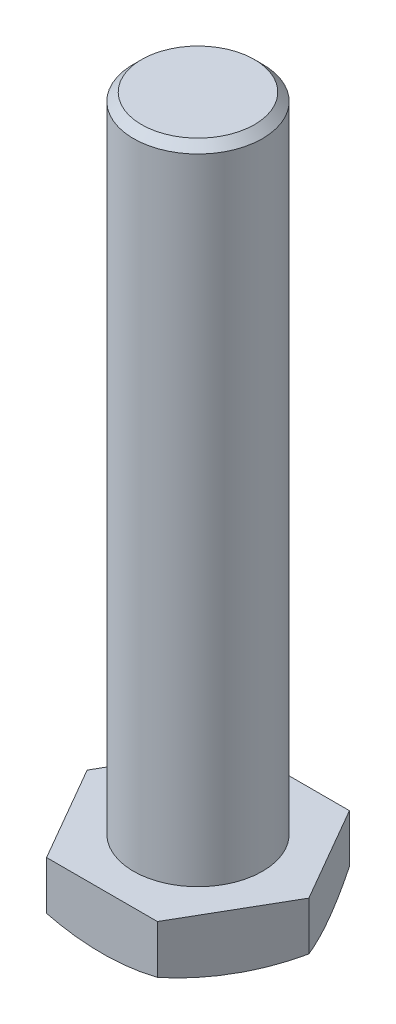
ISO-10303-21;
HEADER;
FILE_DESCRIPTION(('STEP AP214'),'2;1');
FILE_NAME('part.step','',(''),(''),'','','');
FILE_SCHEMA(('AUTOMOTIVE_DESIGN { 1 0 10303 214 1 1 1 1 }'));
ENDSEC;
DATA;
#1=APPLICATION_CONTEXT('core data for automotive mechanical design processes');
#2=APPLICATION_PROTOCOL_DEFINITION('international standard','automotive_design',2000,#1);
#3=PRODUCT_CONTEXT('',#1,'mechanical');
#4=PRODUCT('Part','Part','',(#3));
#5=PRODUCT_RELATED_PRODUCT_CATEGORY('part','',(#4));
#6=PRODUCT_DEFINITION_FORMATION('','',#4);
#7=PRODUCT_DEFINITION_CONTEXT('part definition',#1,'design');
#8=PRODUCT_DEFINITION('design','',#6,#7);
#9=PRODUCT_DEFINITION_SHAPE('','',#8);
#10=(LENGTH_UNIT() NAMED_UNIT(*) SI_UNIT(.MILLI.,.METRE.));
#11=(NAMED_UNIT(*) PLANE_ANGLE_UNIT() SI_UNIT($,.RADIAN.));
#12=(NAMED_UNIT(*) SI_UNIT($,.STERADIAN.) SOLID_ANGLE_UNIT());
#13=UNCERTAINTY_MEASURE_WITH_UNIT(LENGTH_MEASURE(1.E-05),#10,'distance_accuracy_value','');
#14=(GEOMETRIC_REPRESENTATION_CONTEXT(3) GLOBAL_UNCERTAINTY_ASSIGNED_CONTEXT((#13)) GLOBAL_UNIT_ASSIGNED_CONTEXT((#10,
#11,#12)) REPRESENTATION_CONTEXT('',''));
#15=CARTESIAN_POINT('',(0.,0.,0.));
#16=DIRECTION('',(0.,0.,1.));
#17=DIRECTION('',(1.,0.,0.));
#18=AXIS2_PLACEMENT_3D('',#15,#16,#17);
#19=CARTESIAN_POINT('',(0.,17.,0.));
#20=DIRECTION('',(0.,-1.,0.));
#21=DIRECTION('',(0.,0.,-1.));
#22=AXIS2_PLACEMENT_3D('',#19,#20,#21);
#23=PLANE('',#22);
#24=CARTESIAN_POINT('',(0.,17.,0.));
#25=DIRECTION('',(0.,1.,0.));
#26=DIRECTION('',(0.,0.,1.));
#27=AXIS2_PLACEMENT_3D('',#24,#25,#26);
#28=CIRCLE('',#27,2.5);
#29=CARTESIAN_POINT('',(0.,17.,2.5));
#30=VERTEX_POINT('',#29);
#31=EDGE_CURVE('E19',#30,#30,#28,.F.);
#32=ORIENTED_EDGE('',*,*,#31,.T.);
#33=EDGE_LOOP('',(#32));
#34=FACE_BOUND('',#33,.T.);
#35=ADVANCED_FACE('F16',(#34),#23,.T.);
#36=CARTESIAN_POINT('',(0.,0.,0.));
#37=DIRECTION('',(0.,1.,0.));
#38=DIRECTION('',(0.,0.,1.));
#39=AXIS2_PLACEMENT_3D('',#36,#37,#38);
#40=CYLINDRICAL_SURFACE('',#39,2.5);
#41=ORIENTED_EDGE('',*,*,#31,.F.);
#42=EDGE_LOOP('',(#41));
#43=FACE_BOUND('',#42,.T.);
#44=CARTESIAN_POINT('',(0.,0.103325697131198,0.));
#45=DIRECTION('',(0.,1.,0.));
#46=DIRECTION('',(0.,0.,1.));
#47=AXIS2_PLACEMENT_3D('',#44,#45,#46);
#48=CIRCLE('',#47,2.5);
#49=CARTESIAN_POINT('',(0.,0.103325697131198,2.5));
#50=VERTEX_POINT('',#49);
#51=EDGE_CURVE('E77',#50,#50,#48,.T.);
#52=ORIENTED_EDGE('',*,*,#51,.F.);
#53=EDGE_LOOP('',(#52));
#54=FACE_BOUND('',#53,.T.);
#55=ADVANCED_FACE('F105',(#43,#54),#40,.F.);
#56=CARTESIAN_POINT('',(0.,30.2958333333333,0.));
#57=DIRECTION('',(1.,0.,0.));
#58=DIRECTION('',(0.,1.,0.));
#59=AXIS2_PLACEMENT_3D('',#56,#57,#58);
#60=SPHERICAL_SURFACE('',#59,30.29583333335);
#61=CARTESIAN_POINT('',(-6.87500000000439,3.29999999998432,11.9078493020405));
#62=CARTESIAN_POINT('',(-7.13055135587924,3.16982019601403,11.465221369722));
#63=CARTESIAN_POINT('',(-7.3879541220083,3.05418879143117,11.0193867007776));
#64=CARTESIAN_POINT('',(-7.90570575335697,2.85228957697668,10.1226145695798));
#65=CARTESIAN_POINT('',(-8.1660555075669,2.76603088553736,9.67167556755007));
#66=CARTESIAN_POINT('',(-8.68882478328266,2.6232141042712,8.76621262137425));
#67=CARTESIAN_POINT('',(-8.95124461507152,2.5666605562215,8.31168813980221));
#68=CARTESIAN_POINT('',(-9.47187116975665,2.48430472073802,7.40993649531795));
#69=CARTESIAN_POINT('',(-9.73005393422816,2.4578956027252,6.96275082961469));
#70=CARTESIAN_POINT('',(-10.246696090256,2.4338459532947,6.06790036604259));
#71=CARTESIAN_POINT('',(-10.5051554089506,2.43619913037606,5.62023569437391));
#72=CARTESIAN_POINT('',(-11.0215127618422,2.46964754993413,4.72587852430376));
#73=CARTESIAN_POINT('',(-11.279410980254,2.50073120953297,4.27918570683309));
#74=CARTESIAN_POINT('',(-11.722329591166,2.57888615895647,3.51202816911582));
#75=CARTESIAN_POINT('',(-11.9076600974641,2.61910188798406,3.1910263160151));
#76=CARTESIAN_POINT('',(-12.2773314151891,2.71436709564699,2.55073681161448));
#77=CARTESIAN_POINT('',(-12.4616724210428,2.76941354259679,2.23144882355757));
#78=CARTESIAN_POINT('',(-12.8309507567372,2.89488509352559,1.59183998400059));
#79=CARTESIAN_POINT('',(-13.01587539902,2.96545947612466,1.27154110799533));
#80=CARTESIAN_POINT('',(-13.3841810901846,3.1215517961,0.633616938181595));
#81=CARTESIAN_POINT('',(-13.5675618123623,3.20707281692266,0.315992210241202));
#82=CARTESIAN_POINT('',(-13.7500000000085,3.29999999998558,-2.69238485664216E-12));
#83=B_SPLINE_CURVE_WITH_KNOTS('',3,(#61,#62,#63,#64,#65,#66,#67,#68,#69,#70,#71,#72,#73,#74,#75,
#76,#77,#78,#79,#80,#81,#82),.UNSPECIFIED.,.F.,.F.,(4,2,2,2,2,2,2,2,2,2,4),(0.,1.58204619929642,
3.16458308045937,4.74736185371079,6.29768273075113,7.84766449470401,9.39702164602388,
10.5152510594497,11.6332520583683,12.7625111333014,13.892003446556),.UNSPECIFIED.);
#84=CARTESIAN_POINT('',(-6.87500000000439,3.29999999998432,11.9078493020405));
#85=VERTEX_POINT('',#84);
#86=CARTESIAN_POINT('',(-13.7500000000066,3.29999999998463,-3.22736878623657E-12));
#87=VERTEX_POINT('',#86);
#88=EDGE_CURVE('E80',#85,#87,#83,.T.);
#89=ORIENTED_EDGE('',*,*,#88,.T.);
#90=CARTESIAN_POINT('',(-13.7500000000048,3.29999999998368,-3.76148535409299E-12));
#91=CARTESIAN_POINT('',(-13.4944486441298,3.16982019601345,-0.442627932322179));
#92=CARTESIAN_POINT('',(-13.2370458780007,3.05418879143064,-0.888462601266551));
#93=CARTESIAN_POINT('',(-12.7192942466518,2.85228957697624,-1.78523473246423));
#94=CARTESIAN_POINT('',(-12.4589444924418,2.76603088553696,-2.23617373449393));
#95=CARTESIAN_POINT('',(-11.9361752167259,2.6232141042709,-3.14163668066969));
#96=CARTESIAN_POINT('',(-11.673755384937,2.56666055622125,-3.5961611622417));
#97=CARTESIAN_POINT('',(-11.1531288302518,2.48430472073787,-4.49791280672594));
#98=CARTESIAN_POINT('',(-10.8949460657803,2.45789560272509,-4.94509847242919));
#99=CARTESIAN_POINT('',(-10.3783039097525,2.43384595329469,-5.83994893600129));
#100=CARTESIAN_POINT('',(-10.1198445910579,2.4361991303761,-6.28761360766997));
#101=CARTESIAN_POINT('',(-9.6034872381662,2.46964754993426,-7.18197077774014));
#102=CARTESIAN_POINT('',(-9.34558901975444,2.50073120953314,-7.62866359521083));
#103=CARTESIAN_POINT('',(-8.90267040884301,2.57888615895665,-8.39582113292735));
#104=CARTESIAN_POINT('',(-8.71733990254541,2.61910188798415,-8.71682298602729));
#105=CARTESIAN_POINT('',(-8.34766858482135,2.71436709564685,-9.35711249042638));
#106=CARTESIAN_POINT('',(-8.16332757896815,2.76941354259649,-9.67640047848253));
#107=CARTESIAN_POINT('',(-7.7940492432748,2.89488509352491,-10.316009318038));
#108=CARTESIAN_POINT('',(-7.60912460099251,2.96545947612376,-10.6363081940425));
#109=CARTESIAN_POINT('',(-7.24081890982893,3.12155179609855,-11.2742323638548));
#110=CARTESIAN_POINT('',(-7.05743818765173,3.20707281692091,-11.5918570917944));
#111=CARTESIAN_POINT('',(-6.87500000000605,3.29999999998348,-11.9078493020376));
#112=B_SPLINE_CURVE_WITH_KNOTS('',3,(#90,#91,#92,#93,#94,#95,#96,#97,#98,#99,#100,#101,#102,
#103,#104,#105,#106,#107,#108,#109,#110,#111),.UNSPECIFIED.,.F.,.F.,(4,2,2,2,2,2,2,2,2,2,4),(0.,
1.58204619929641,3.16458308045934,4.74736185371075,6.29768273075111,7.847664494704,
9.39702164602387,10.5152510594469,11.6332520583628,12.7625111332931,13.8920034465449),.UNSPECIFIED.);
#113=CARTESIAN_POINT('',(-6.87500000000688,3.29999999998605,-11.907849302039));
#114=VERTEX_POINT('',#113);
#115=EDGE_CURVE('E65',#87,#114,#112,.T.);
#116=ORIENTED_EDGE('',*,*,#115,.T.);
#117=CARTESIAN_POINT('',(-6.87500000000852,3.29999999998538,-11.9078493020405));
#118=CARTESIAN_POINT('',(-6.36389728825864,3.16982019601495,-11.9078493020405));
#119=CARTESIAN_POINT('',(-5.84909175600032,3.05418879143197,-11.9078493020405));
#120=CARTESIAN_POINT('',(-4.81358849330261,2.85228957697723,-11.9078493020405));
#121=CARTESIAN_POINT('',(-4.29288898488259,2.76603088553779,-11.9078493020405));
#122=CARTESIAN_POINT('',(-3.24735043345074,2.62321410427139,-11.9078493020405));
#123=CARTESIAN_POINT('',(-2.72251076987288,2.56666055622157,-11.9078493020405));
#124=CARTESIAN_POINT('',(-1.68125766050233,2.48430472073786,-11.9078493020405));
#125=CARTESIAN_POINT('',(-1.16489213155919,2.45789560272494,-11.9078493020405));
#126=CARTESIAN_POINT('',(-0.131607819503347,2.43384595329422,-11.9078493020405));
#127=CARTESIAN_POINT('',(0.38531081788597,2.43619913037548,-11.9078493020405));
#128=CARTESIAN_POINT('',(1.41802552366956,2.46964754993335,-11.9078493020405));
#129=CARTESIAN_POINT('',(1.93382196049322,2.50073120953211,-11.9078493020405));
#130=CARTESIAN_POINT('',(2.81965918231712,2.57888615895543,-11.9078493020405));
#131=CARTESIAN_POINT('',(3.19032019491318,2.61910188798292,-11.9078493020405));
#132=CARTESIAN_POINT('',(3.92966283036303,2.71436709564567,-11.9078493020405));
#133=CARTESIAN_POINT('',(4.29834484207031,2.76941354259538,-11.9078493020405));
#134=CARTESIAN_POINT('',(5.03690151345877,2.89488509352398,-11.9078493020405));
#135=CARTESIAN_POINT('',(5.40675079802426,2.96545947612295,-11.9078493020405));
#136=CARTESIAN_POINT('',(6.14336218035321,3.12155179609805,-11.9078493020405));
#137=CARTESIAN_POINT('',(6.5101236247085,3.20707281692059,-11.9078493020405));
#138=CARTESIAN_POINT('',(6.87500000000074,3.29999999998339,-11.9078493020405));
#139=B_SPLINE_CURVE_WITH_KNOTS('',3,(#117,#118,#119,#120,#121,#122,#123,#124,#125,#126,#127,
#128,#129,#130,#131,#132,#133,#134,#135,#136,#137,#138),.UNSPECIFIED.,.F.,.F.,(4,2,2,2,2,2,2,2,
2,2,4),(0.,1.58204619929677,3.16458308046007,4.74736185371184,6.29768273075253,7.84766449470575,
9.39702164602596,10.5152510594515,11.6332520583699,12.7625111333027,13.892003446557),.UNSPECIFIED.);
#140=CARTESIAN_POINT('',(6.87500000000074,3.29999999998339,-11.9078493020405));
#141=VERTEX_POINT('',#140);
#142=EDGE_CURVE('E116',#114,#141,#139,.T.);
#143=ORIENTED_EDGE('',*,*,#142,.T.);
#144=CARTESIAN_POINT('',(6.87500000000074,3.29999999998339,-11.9078493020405));
#145=CARTESIAN_POINT('',(7.13055135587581,3.16982019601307,-11.4652213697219));
#146=CARTESIAN_POINT('',(7.38795412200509,3.05418879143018,-11.0193867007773));
#147=CARTESIAN_POINT('',(7.90570575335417,2.85228957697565,-10.1226145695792));
#148=CARTESIAN_POINT('',(8.16605550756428,2.76603088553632,-9.67167556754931));
#149=CARTESIAN_POINT('',(8.6888247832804,2.62321410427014,-8.76621262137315));
#150=CARTESIAN_POINT('',(8.95124461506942,2.56666055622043,-8.31168813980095));
#151=CARTESIAN_POINT('',(9.47187116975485,2.48430472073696,-7.40993649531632));
#152=CARTESIAN_POINT('',(9.73005393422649,2.45789560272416,-6.96275082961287));
#153=CARTESIAN_POINT('',(10.2466960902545,2.43384595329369,-6.06790036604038));
#154=CARTESIAN_POINT('',(10.5051554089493,2.43619913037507,-5.62023569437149));
#155=CARTESIAN_POINT('',(11.0215127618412,2.4696475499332,-4.72587852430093));
#156=CARTESIAN_POINT('',(11.279410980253,2.5007312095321,-4.27918570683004));
#157=CARTESIAN_POINT('',(11.7223295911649,2.57888615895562,-3.51202816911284));
#158=CARTESIAN_POINT('',(11.9076600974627,2.61910188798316,-3.19102631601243));
#159=CARTESIAN_POINT('',(12.2773314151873,2.71436709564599,-2.55073681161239));
#160=CARTESIAN_POINT('',(12.4616724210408,2.76941354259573,-2.23144882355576));
#161=CARTESIAN_POINT('',(12.8309507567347,2.89488509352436,-1.59183998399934));
#162=CARTESIAN_POINT('',(13.0158753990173,2.96545947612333,-1.27154110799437));
#163=CARTESIAN_POINT('',(13.3841810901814,3.12155179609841,-0.633616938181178));
#164=CARTESIAN_POINT('',(13.5675618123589,3.20707281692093,-0.315992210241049));
#165=CARTESIAN_POINT('',(13.7500000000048,3.29999999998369,2.59326830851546E-12));
#166=B_SPLINE_CURVE_WITH_KNOTS('',3,(#144,#145,#146,#147,#148,#149,#150,#151,#152,#153,#154,
#155,#156,#157,#158,#159,#160,#161,#162,#163,#164,#165),.UNSPECIFIED.,.F.,.F.,(4,2,2,2,2,2,2,2,
2,2,4),(0.,1.58204619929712,3.16458308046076,4.74736185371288,6.29768273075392,7.84766449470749,
9.39702164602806,10.5152510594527,11.6332520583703,12.7625111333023,13.8920034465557),.UNSPECIFIED.);
#167=CARTESIAN_POINT('',(13.7500000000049,3.29999999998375,-2.00873279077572E-13));
#168=VERTEX_POINT('',#167);
#169=EDGE_CURVE('E124',#141,#168,#166,.T.);
#170=ORIENTED_EDGE('',*,*,#169,.T.);
#171=CARTESIAN_POINT('',(13.750000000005,3.29999999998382,-2.99349698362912E-12));
#172=CARTESIAN_POINT('',(13.4944486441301,3.16982019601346,0.442627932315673));
#173=CARTESIAN_POINT('',(13.2370458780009,3.05418879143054,0.888462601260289));
#174=CARTESIAN_POINT('',(12.719294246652,2.85228957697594,1.78523473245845));
#175=CARTESIAN_POINT('',(12.458944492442,2.76603088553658,2.23617373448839));
#176=CARTESIAN_POINT('',(11.936175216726,2.62321410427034,3.14163668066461));
#177=CARTESIAN_POINT('',(11.673755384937,2.5666605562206,3.59616116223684));
#178=CARTESIAN_POINT('',(11.1531288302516,2.48430472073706,4.49791280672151));
#179=CARTESIAN_POINT('',(10.89494606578,2.45789560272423,4.94509847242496));
#180=CARTESIAN_POINT('',(10.378303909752,2.43384595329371,5.83994893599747));
#181=CARTESIAN_POINT('',(10.1198445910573,2.43619913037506,6.28761360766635));
#182=CARTESIAN_POINT('',(9.60348723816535,2.46964754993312,7.1819707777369));
#183=CARTESIAN_POINT('',(9.34558901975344,2.50073120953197,7.62866359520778));
#184=CARTESIAN_POINT('',(8.90267040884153,2.57888615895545,8.39582113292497));
#185=CARTESIAN_POINT('',(8.71733990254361,2.61910188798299,8.7168229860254));
#186=CARTESIAN_POINT('',(8.34766858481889,2.71436709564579,9.35711249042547));
#187=CARTESIAN_POINT('',(8.16332757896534,2.76941354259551,9.67640047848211));
#188=CARTESIAN_POINT('',(7.7940492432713,2.89488509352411,10.3160093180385));
#189=CARTESIAN_POINT('',(7.60912460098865,2.96545947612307,10.6363081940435));
#190=CARTESIAN_POINT('',(7.24081890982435,3.12155179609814,11.2742323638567));
#191=CARTESIAN_POINT('',(7.05743818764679,3.20707281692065,11.5918570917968));
#192=CARTESIAN_POINT('',(6.87500000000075,3.29999999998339,11.9078493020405));
#193=B_SPLINE_CURVE_WITH_KNOTS('',3,(#171,#172,#173,#174,#175,#176,#177,#178,#179,#180,#181,
#182,#183,#184,#185,#186,#187,#188,#189,#190,#191,#192),.UNSPECIFIED.,.F.,.F.,(4,2,2,2,2,2,2,2,
2,2,4),(0.,1.58204619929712,3.16458308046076,4.74736185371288,6.29768273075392,7.84766449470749,
9.39702164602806,10.5152510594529,11.6332520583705,12.7625111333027,13.8920034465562),.UNSPECIFIED.);
#194=CARTESIAN_POINT('',(6.87500000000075,3.29999999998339,11.9078493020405));
#195=VERTEX_POINT('',#194);
#196=EDGE_CURVE('E130',#168,#195,#193,.T.);
#197=ORIENTED_EDGE('',*,*,#196,.T.);
#198=CARTESIAN_POINT('',(6.87500000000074,3.29999999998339,11.9078493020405));
#199=CARTESIAN_POINT('',(6.36389728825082,3.16982019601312,11.9078493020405));
#200=CARTESIAN_POINT('',(5.84909175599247,3.05418879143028,11.9078493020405));
#201=CARTESIAN_POINT('',(4.81358849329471,2.85228957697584,11.9078493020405));
#202=CARTESIAN_POINT('',(4.29288898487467,2.76603088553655,11.9078493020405));
#203=CARTESIAN_POINT('',(3.24735043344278,2.62321410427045,11.9078493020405));
#204=CARTESIAN_POINT('',(2.7225107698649,2.56666055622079,11.9078493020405));
#205=CARTESIAN_POINT('',(1.68125766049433,2.48430472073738,11.9078493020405));
#206=CARTESIAN_POINT('',(1.16489213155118,2.4578956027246,11.9078493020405));
#207=CARTESIAN_POINT('',(0.131607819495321,2.43384595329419,11.9078493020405));
#208=CARTESIAN_POINT('',(-0.385310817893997,2.4361991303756,11.9078493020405));
#209=CARTESIAN_POINT('',(-1.41802552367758,2.46964754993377,11.9078493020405));
#210=CARTESIAN_POINT('',(-1.93382196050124,2.50073120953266,11.9078493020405));
#211=CARTESIAN_POINT('',(-2.81965918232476,2.57888615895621,11.9078493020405));
#212=CARTESIAN_POINT('',(-3.19032019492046,2.61910188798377,11.9078493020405));
#213=CARTESIAN_POINT('',(-3.92966283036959,2.71436709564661,11.9078493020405));
#214=CARTESIAN_POINT('',(-4.29834484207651,2.76941354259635,11.9078493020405));
#215=CARTESIAN_POINT('',(-5.03690151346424,2.89488509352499,11.9078493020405));
#216=CARTESIAN_POINT('',(-5.40675079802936,2.96545947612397,11.9078493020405));
#217=CARTESIAN_POINT('',(-6.14336218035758,3.12155179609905,11.9078493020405));
#218=CARTESIAN_POINT('',(-6.51012362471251,3.20707281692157,11.9078493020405));
#219=CARTESIAN_POINT('',(-6.87500000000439,3.29999999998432,11.9078493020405));
#220=B_SPLINE_CURVE_WITH_KNOTS('',3,(#198,#199,#200,#201,#202,#203,#204,#205,#206,#207,#208,
#209,#210,#211,#212,#213,#214,#215,#216,#217,#218,#219),.UNSPECIFIED.,.F.,.F.,(4,2,2,2,2,2,2,2,
2,2,4),(0.,1.58204619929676,3.16458308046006,4.74736185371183,6.29768273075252,7.84766449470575,
9.39702164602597,10.5152510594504,11.6332520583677,12.7625111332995,13.8920034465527),.UNSPECIFIED.);
#221=EDGE_CURVE('E84',#195,#85,#220,.T.);
#222=ORIENTED_EDGE('',*,*,#221,.T.);
#223=EDGE_LOOP('',(#89,#116,#143,#170,#197,#222));
#224=FACE_BOUND('',#223,.T.);
#225=ORIENTED_EDGE('',*,*,#51,.T.);
#226=EDGE_LOOP('',(#225));
#227=FACE_BOUND('',#226,.T.);
#228=ADVANCED_FACE('F81',(#224,#227),#60,.T.);
#229=CARTESIAN_POINT('',(-13.7500000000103,9.29999999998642,0.));
#230=DIRECTION('',(0.866025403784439,4.777601E-13,0.5));
#231=DIRECTION('',(0.5,0.,-0.866025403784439));
#232=AXIS2_PLACEMENT_3D('',#229,#230,#231);
#233=PLANE('',#232);
#234=DIRECTION('',(-4.13752383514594E-13,1.,2.3888005E-13));
#235=VECTOR('',#234,1.);
#236=CARTESIAN_POINT('',(-13.7500000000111,9.29999999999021,-1.43288159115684E-12));
#237=LINE('',#236,#235);
#238=CARTESIAN_POINT('',(-13.7500000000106,9.29999999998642,-6.55360536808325E-13));
#239=VERTEX_POINT('',#238);
#240=EDGE_CURVE('E70',#87,#239,#237,.T.);
#241=ORIENTED_EDGE('',*,*,#240,.T.);
#242=DIRECTION('',(-0.5,-2.75915653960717E-13,0.866025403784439));
#243=VECTOR('',#242,1.);
#244=CARTESIAN_POINT('',(-6.8750000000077,9.29999999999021,-11.9078493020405));
#245=LINE('',#244,#243);
#246=CARTESIAN_POINT('',(-6.8750000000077,9.2999999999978,-11.9078493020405));
#247=VERTEX_POINT('',#246);
#248=EDGE_CURVE('E99',#247,#239,#245,.T.);
#249=ORIENTED_EDGE('',*,*,#248,.F.);
#250=DIRECTION('',(0.,1.,0.));
#251=VECTOR('',#250,1.);
#252=CARTESIAN_POINT('',(-6.8750000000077,9.29999999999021,-11.9078493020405));
#253=LINE('',#252,#251);
#254=EDGE_CURVE('E73',#247,#114,#253,.F.);
#255=ORIENTED_EDGE('',*,*,#254,.T.);
#256=ORIENTED_EDGE('',*,*,#115,.F.);
#257=EDGE_LOOP('',(#241,#249,#255,#256));
#258=FACE_BOUND('',#257,.T.);
#259=ADVANCED_FACE('F67',(#258),#233,.F.);
#260=CARTESIAN_POINT('',(-6.8750000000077,9.29999999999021,11.9078493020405));
#261=DIRECTION('',(0.866025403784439,4.777601E-13,-0.5));
#262=DIRECTION('',(-0.5,0.,-0.866025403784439));
#263=AXIS2_PLACEMENT_3D('',#260,#261,#262);
#264=PLANE('',#263);
#265=DIRECTION('',(0.,1.,0.));
#266=VECTOR('',#265,1.);
#267=CARTESIAN_POINT('',(-6.87500000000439,9.2999999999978,11.9078493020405));
#268=LINE('',#267,#266);
#269=CARTESIAN_POINT('',(-6.87500000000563,9.29999999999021,11.9078493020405));
#270=VERTEX_POINT('',#269);
#271=EDGE_CURVE('E87',#85,#270,#268,.T.);
#272=ORIENTED_EDGE('',*,*,#271,.T.);
#273=DIRECTION('',(0.5,2.75915653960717E-13,0.866025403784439));
#274=VECTOR('',#273,1.);
#275=CARTESIAN_POINT('',(-13.7500000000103,9.29999999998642,0.));
#276=LINE('',#275,#274);
#277=EDGE_CURVE('E91',#239,#270,#276,.T.);
#278=ORIENTED_EDGE('',*,*,#277,.F.);
#279=ORIENTED_EDGE('',*,*,#240,.F.);
#280=ORIENTED_EDGE('',*,*,#88,.F.);
#281=EDGE_LOOP('',(#272,#278,#279,#280));
#282=FACE_BOUND('',#281,.T.);
#283=ADVANCED_FACE('F89',(#282),#264,.F.);
#284=CARTESIAN_POINT('',(6.87499999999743,9.2999999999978,11.9078493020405));
#285=DIRECTION('',(0.,0.,-1.));
#286=DIRECTION('',(-1.,0.,0.));
#287=AXIS2_PLACEMENT_3D('',#284,#285,#286);
#288=PLANE('',#287);
#289=DIRECTION('',(-4.13835608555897E-13,1.,-2.389281E-13));
#290=VECTOR('',#289,1.);
#291=CARTESIAN_POINT('',(6.87499999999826,9.30000000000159,11.907849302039));
#292=LINE('',#291,#290);
#293=CARTESIAN_POINT('',(6.87499999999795,9.2999999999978,11.9078493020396));
#294=VERTEX_POINT('',#293);
#295=EDGE_CURVE('E140',#195,#294,#292,.T.);
#296=ORIENTED_EDGE('',*,*,#295,.T.);
#297=DIRECTION('',(-1.,-5.517156E-13,0.));
#298=VECTOR('',#297,1.);
#299=CARTESIAN_POINT('',(10.875,9.3,11.9078493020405));
#300=LINE('',#299,#298);
#301=EDGE_CURVE('E204',#270,#294,#300,.F.);
#302=ORIENTED_EDGE('',*,*,#301,.F.);
#303=ORIENTED_EDGE('',*,*,#271,.F.);
#304=ORIENTED_EDGE('',*,*,#221,.F.);
#305=EDGE_LOOP('',(#296,#302,#303,#304));
#306=FACE_BOUND('',#305,.T.);
#307=ADVANCED_FACE('F144',(#306),#288,.F.);
#308=CARTESIAN_POINT('',(13.75,9.30000000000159,0.));
#309=DIRECTION('',(-0.866025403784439,-4.778562E-13,-0.5));
#310=DIRECTION('',(-0.5,0.,0.866025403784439));
#311=AXIS2_PLACEMENT_3D('',#308,#309,#310);
#312=PLANE('',#311);
#313=DIRECTION('',(-4.13752383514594E-13,1.,2.3888005E-13));
#314=VECTOR('',#313,1.);
#315=CARTESIAN_POINT('',(13.75,9.2999999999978,0.));
#316=LINE('',#315,#314);
#317=CARTESIAN_POINT('',(13.75,9.3000000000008,0.));
#318=VERTEX_POINT('',#317);
#319=EDGE_CURVE('E190',#168,#318,#316,.T.);
#320=ORIENTED_EDGE('',*,*,#319,.T.);
#321=DIRECTION('',(0.5,2.75789492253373E-13,-0.866025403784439));
#322=VECTOR('',#321,1.);
#323=CARTESIAN_POINT('',(6.87499999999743,9.2999999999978,11.9078493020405));
#324=LINE('',#323,#322);
#325=EDGE_CURVE('E193',#294,#318,#324,.T.);
#326=ORIENTED_EDGE('',*,*,#325,.F.);
#327=ORIENTED_EDGE('',*,*,#295,.F.);
#328=ORIENTED_EDGE('',*,*,#196,.F.);
#329=EDGE_LOOP('',(#320,#326,#327,#328));
#330=FACE_BOUND('',#329,.T.);
#331=ADVANCED_FACE('F147',(#330),#312,.F.);
#332=CARTESIAN_POINT('',(6.87499999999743,9.2999999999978,-11.9078493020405));
#333=DIRECTION('',(-0.866025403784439,-4.777601E-13,0.5));
#334=DIRECTION('',(0.5,0.,0.866025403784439));
#335=AXIS2_PLACEMENT_3D('',#332,#333,#334);
#336=PLANE('',#335);
#337=DIRECTION('',(0.,1.,0.));
#338=VECTOR('',#337,1.);
#339=CARTESIAN_POINT('',(6.87500000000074,9.29999999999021,-11.9078493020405));
#340=LINE('',#339,#338);
#341=CARTESIAN_POINT('',(6.8749999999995,9.2999999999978,-11.9078493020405));
#342=VERTEX_POINT('',#341);
#343=EDGE_CURVE('E34',#141,#342,#340,.T.);
#344=ORIENTED_EDGE('',*,*,#343,.T.);
#345=DIRECTION('',(-0.5,-2.75789492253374E-13,-0.866025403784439));
#346=VECTOR('',#345,1.);
#347=CARTESIAN_POINT('',(13.75,9.30000000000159,0.));
#348=LINE('',#347,#346);
#349=EDGE_CURVE('E198',#318,#342,#348,.T.);
#350=ORIENTED_EDGE('',*,*,#349,.F.);
#351=ORIENTED_EDGE('',*,*,#319,.F.);
#352=ORIENTED_EDGE('',*,*,#169,.F.);
#353=EDGE_LOOP('',(#344,#350,#351,#352));
#354=FACE_BOUND('',#353,.T.);
#355=ADVANCED_FACE('F178',(#354),#336,.F.);
#356=CARTESIAN_POINT('',(-6.8750000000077,9.29999999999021,-11.9078493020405));
#357=DIRECTION('',(0.,0.,1.));
#358=DIRECTION('',(1.,0.,0.));
#359=AXIS2_PLACEMENT_3D('',#356,#357,#358);
#360=PLANE('',#359);
#361=ORIENTED_EDGE('',*,*,#254,.F.);
#362=DIRECTION('',(-1.,-5.517156E-13,0.));
#363=VECTOR('',#362,1.);
#364=CARTESIAN_POINT('',(10.875,9.3,-11.9078493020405));
#365=LINE('',#364,#363);
#366=EDGE_CURVE('E201',#342,#247,#365,.T.);
#367=ORIENTED_EDGE('',*,*,#366,.F.);
#368=ORIENTED_EDGE('',*,*,#343,.F.);
#369=ORIENTED_EDGE('',*,*,#142,.F.);
#370=EDGE_LOOP('',(#361,#367,#368,#369));
#371=FACE_BOUND('',#370,.T.);
#372=ADVANCED_FACE('F174',(#371),#360,.F.);
#373=CARTESIAN_POINT('',(3.99999999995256,88.9999999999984,0.));
#374=DIRECTION('',(-5.517156E-13,1.,0.));
#375=DIRECTION('',(-1.,-5.517156E-13,0.));
#376=AXIS2_PLACEMENT_3D('',#373,#374,#375);
#377=PLANE('',#376);
#378=CARTESIAN_POINT('',(-4.91022153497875E-11,89.0000000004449,0.));
#379=DIRECTION('',(5.51642065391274E-13,-1.,0.));
#380=DIRECTION('',(1.,5.51642065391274E-13,0.));
#381=AXIS2_PLACEMENT_3D('',#378,#379,#380);
#382=CIRCLE('',#381,7.00000000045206);
#383=CARTESIAN_POINT('',(7.00000000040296,89.0000000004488,0.));
#384=VERTEX_POINT('',#383);
#385=EDGE_CURVE('E210',#384,#384,#382,.T.);
#386=ORIENTED_EDGE('',*,*,#385,.F.);
#387=EDGE_LOOP('',(#386));
#388=FACE_BOUND('',#387,.T.);
#389=ADVANCED_FACE('F171',(#388),#377,.T.);
#390=CARTESIAN_POINT('',(10.875,9.3,0.));
#391=DIRECTION('',(-5.517156E-13,1.,0.));
#392=DIRECTION('',(-1.,-5.517156E-13,0.));
#393=AXIS2_PLACEMENT_3D('',#390,#391,#392);
#394=PLANE('',#393);
#395=CARTESIAN_POINT('',(-5.13095334E-12,9.29999999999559,0.));
#396=DIRECTION('',(5.517156E-13,-1.,0.));
#397=DIRECTION('',(1.,5.517156E-13,0.));
#398=AXIS2_PLACEMENT_3D('',#395,#396,#397);
#399=CIRCLE('',#398,8.00000000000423);
#400=CARTESIAN_POINT('',(7.9999999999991,9.3,0.));
#401=VERTEX_POINT('',#400);
#402=EDGE_CURVE('E25',#401,#401,#399,.F.);
#403=ORIENTED_EDGE('',*,*,#402,.F.);
#404=EDGE_LOOP('',(#403));
#405=FACE_BOUND('',#404,.T.);
#406=ORIENTED_EDGE('',*,*,#349,.T.);
#407=ORIENTED_EDGE('',*,*,#366,.T.);
#408=ORIENTED_EDGE('',*,*,#248,.T.);
#409=ORIENTED_EDGE('',*,*,#277,.T.);
#410=ORIENTED_EDGE('',*,*,#301,.T.);
#411=ORIENTED_EDGE('',*,*,#325,.T.);
#412=EDGE_LOOP('',(#406,#407,#408,#409,#410,#411));
#413=FACE_BOUND('',#412,.T.);
#414=ADVANCED_FACE('F164',(#405,#413),#394,.T.);
#415=CARTESIAN_POINT('',(-4.85505732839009E-11,87.9999999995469,0.));
#416=DIRECTION('',(5.51642065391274E-13,-1.,0.));
#417=DIRECTION('',(1.,5.51642065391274E-13,0.));
#418=AXIS2_PLACEMENT_3D('',#415,#416,#417);
#419=CONICAL_SURFACE('',#418,7.99999999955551,0.785398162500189);
#420=CARTESIAN_POINT('',(-4.855097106E-11,87.9999999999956,0.));
#421=DIRECTION('',(5.517156E-13,-1.,0.));
#422=DIRECTION('',(1.,5.517156E-13,0.));
#423=AXIS2_PLACEMENT_3D('',#420,#421,#422);
#424=CIRCLE('',#423,8.00000000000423);
#425=CARTESIAN_POINT('',(7.99999999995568,88.,0.));
#426=VERTEX_POINT('',#425);
#427=EDGE_CURVE('E11',#426,#426,#424,.T.);
#428=ORIENTED_EDGE('',*,*,#427,.F.);
#429=EDGE_LOOP('',(#428));
#430=FACE_BOUND('',#429,.T.);
#431=ORIENTED_EDGE('',*,*,#385,.T.);
#432=EDGE_LOOP('',(#431));
#433=FACE_BOUND('',#432,.T.);
#434=ADVANCED_FACE('F158',(#430,#433),#419,.T.);
#435=CARTESIAN_POINT('',(-2.711682E-11,49.1499999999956,0.));
#436=DIRECTION('',(5.517156E-13,-1.,0.));
#437=DIRECTION('',(1.,5.517156E-13,0.));
#438=AXIS2_PLACEMENT_3D('',#435,#436,#437);
#439=CYLINDRICAL_SURFACE('',#438,8.00000000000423);
#440=ORIENTED_EDGE('',*,*,#427,.T.);
#441=EDGE_LOOP('',(#440));
#442=FACE_BOUND('',#441,.T.);
#443=ORIENTED_EDGE('',*,*,#402,.T.);
#444=EDGE_LOOP('',(#443));
#445=FACE_BOUND('',#444,.T.);
#446=ADVANCED_FACE('F156',(#442,#445),#439,.T.);
#447=CLOSED_SHELL('',(#35,#55,#228,#259,#283,#307,#331,#355,#372,#389,#414,#434,#446));
#448=MANIFOLD_SOLID_BREP('B1',#447);
#449=ADVANCED_BREP_SHAPE_REPRESENTATION('',(#18,#448),#14);
#450=SHAPE_DEFINITION_REPRESENTATION(#9,#449);
ENDSEC;
END-ISO-10303-21;
